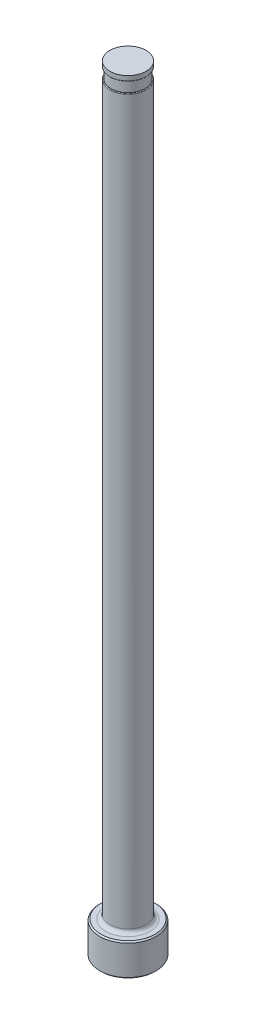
from build123d import *

# Parameters (mm, degrees)
CHAMFER1_SIZE     = 0.254
FILLET1_R         = 0.762
SKETCH2_W         = 0.2032
SKETCH2_H         = 2.032
D_SLOT_DEPTH      = 153.60197502
D_SLOT_DEPTH_BACK = 153.60197502
SKETCH5_W         = 0.00508
SKETCH5_H         = 1.016
FILLET2_R         = 0.127


with BuildPart() as part:
    # Sketch1 → Revolve1 (revolve)
    with BuildSketch(Plane.XY, mode=Mode.PRIVATE) as revolve1_sk:
        Polygon((0, 0), (-5.5499, 0), (-5.5499, 6.35), (-3.57124, 6.35), (-3.57124, 152.4), (0, 152.4), align=None)
    revolve(revolve1_sk.sketch.rotate(Axis((0, 259.958771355, 0), (0, -1, 0)), 270), axis=Axis((0, 259.958771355, 0), (0, -1, 0)))

    # Chamfer1
    chamfer1_edges = [part.edges().sort_by_distance(p)[0] for p in [
        (0, 6.35, -5.5499),
        (0, 0, -5.5499),
    ]]
    chamfer(chamfer1_edges, length=CHAMFER1_SIZE)

    # Fillet1
    fillet1_edges = [part.edges().sort_by_distance(p)[0] for p in [
        (0, 6.35, -3.57124),
    ]]
    fillet(fillet1_edges, radius=FILLET1_R)

    # Sketch2 → Vent Relief (revolve, cut)
    with BuildSketch(Plane.XY, mode=Mode.PRIVATE) as vent_relief_sk:
        with Locations((-3.46964, 150.368)):
            Rectangle(SKETCH2_W, SKETCH2_H)
    revolve(vent_relief_sk.sketch.rotate(Axis((0, 153.448281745, 0), (0, -1, 0)), 270), axis=Axis((0, 153.448281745, 0), (0, -1, 0)), mode=Mode.SUBTRACT)

    # Sketch3 → D-Slot (cut, two sides: drawn at the far end of the back side and taken through both)
    with BuildSketch(Plane.XY.offset(-D_SLOT_DEPTH_BACK)):
        with BuildLine():
            Line((-3.36804, 150.368), (-3.36804, 86.868))
            ThreePointArc((-3.36804, 86.868), (-3.419253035, 86.300038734), (-3.57124, 85.7504))
            Line((-3.57124, 85.7504), (-3.57124, 150.368))
            Line((-3.57124, 150.368), (-3.36804, 150.368))
        make_face()
    extrude(amount=D_SLOT_DEPTH + D_SLOT_DEPTH_BACK, mode=Mode.SUBTRACT)

    # Sketch5 → Vent Diameter (revolve, cut)
    with BuildSketch(Plane.XY, mode=Mode.PRIVATE) as vent_diameter_sk:
        with Locations((-3.5687, 151.892)):
            Rectangle(SKETCH5_W, SKETCH5_H)
    revolve(vent_diameter_sk.sketch.rotate(Axis((0, 152.687735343, 0), (0, -1, 0)), 90), axis=Axis((0, 152.687735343, 0), (0, -1, 0)), mode=Mode.SUBTRACT)

    # Fillet2
    fillet2_edges = [part.edges().sort_by_distance(p)[0] for p in [
        (2.915000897, 149.352, -2.063134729),
        (0, 151.384, 3.56616),
    ]]
    fillet(fillet2_edges, radius=FILLET2_R)


solid = part.part
